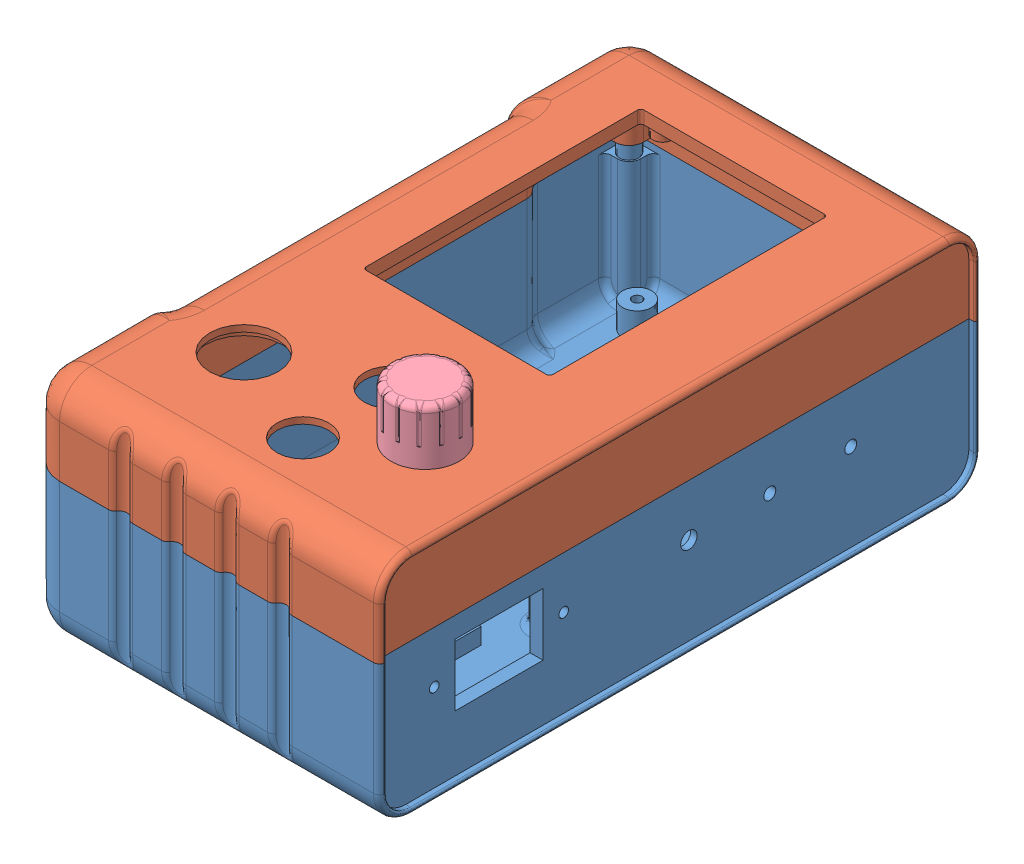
SolidWorks assembly Assembly.SLDASM, configuration Default (file format 13000). Lengths in mm.
Overall size (108.91 93.52 186).
4 component instances, 4 part files, 7 mates.
Components (placement in the parent):
- Lower_Enclosure-1: Lower_Enclosure.SLDPRT [Default] at (84.1857 59.2378 143.391) size (108.91 50.58 186)
- Upper_Enclosure-1: Upper_Enclosure.SLDPRT [Default] at (84.1857 130.2378 143.391) x (1 0 0) z (0 0 -1) size (108.91 26.58 186)
- Strip-1: Strip.SLDPRT [Default] at (76.1857 86.2378 194.583) x (0 0 1) z (-1 0 0) size (59 2 9)
- Knob-1: Knob.SLDPRT [Default] at (117.4357 152.0499 200.141) x (0.850817 0 0.525462) z (0.525462 0 -0.850817) size (21.2 17.13 21.11)
Mates (geometry in assembly coordinates):
- Coincident1: coincident anti-aligned: plane of Lower_Enclosure-1 through (76.1857 86.2378 169.583) normal (0 1 0); plane of Strip-1 through (76.1857 86.2378 219.583) normal (0 -1 0)
- Concentric1: concentric aligned: circle of Lower_Enclosure-1; circle of Strip-1
- Concentric2: concentric aligned: circle of Lower_Enclosure-1; circle of Strip-1
- Coincident2: coincident anti-aligned: plane of Lower_Enclosure-1 through (84.1857 104.2378 143.391) normal (0 1 0); plane of Upper_Enclosure-1 through (84.1857 104.2378 143.391) normal (0 -1 0)
- Coincident3: coincident aligned: plane of Lower_Enclosure-1 through (33.3357 63.2378 90.391) normal (-1 0 0); plane of Upper_Enclosure-1 through (33.3357 126.2378 196.391) normal (-1 0 0)
- Coincident4: coincident aligned: plane of Lower_Enclosure-1 through (30.6857 63.2378 50.391) normal (0 0 -1); plane of Upper_Enclosure-1 through (30.6857 126.2378 50.391) normal (0 0 -1)
- Concentric3: concentric aligned: circle of Upper_Enclosure-1; circle of Knob-1
